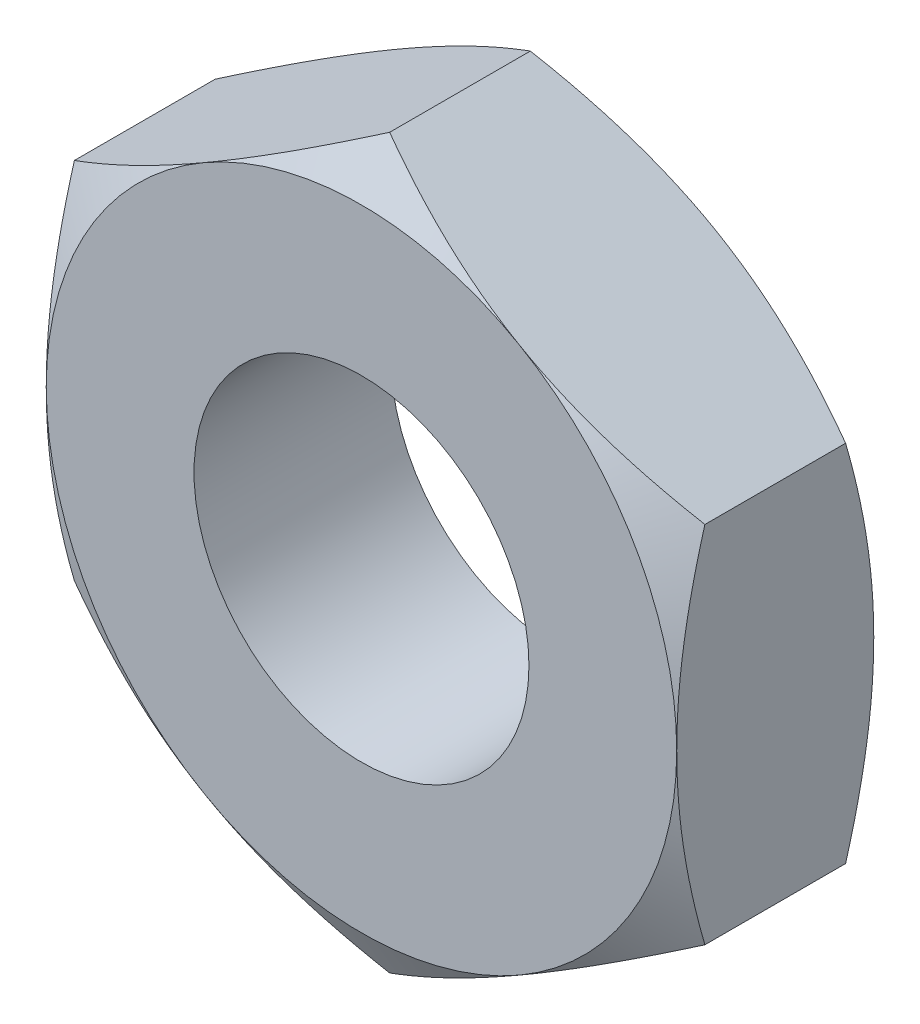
ISO-10303-21;
HEADER;
FILE_DESCRIPTION(('STEP AP214'),'2;1');
FILE_NAME('part.step','',(''),(''),'','','');
FILE_SCHEMA(('AUTOMOTIVE_DESIGN { 1 0 10303 214 1 1 1 1 }'));
ENDSEC;
DATA;
#1=APPLICATION_CONTEXT('core data for automotive mechanical design processes');
#2=APPLICATION_PROTOCOL_DEFINITION('international standard','automotive_design',2000,#1);
#3=PRODUCT_CONTEXT('',#1,'mechanical');
#4=PRODUCT('Part','Part','',(#3));
#5=PRODUCT_RELATED_PRODUCT_CATEGORY('part','',(#4));
#6=PRODUCT_DEFINITION_FORMATION('','',#4);
#7=PRODUCT_DEFINITION_CONTEXT('part definition',#1,'design');
#8=PRODUCT_DEFINITION('design','',#6,#7);
#9=PRODUCT_DEFINITION_SHAPE('','',#8);
#10=(LENGTH_UNIT() NAMED_UNIT(*) SI_UNIT(.MILLI.,.METRE.));
#11=(NAMED_UNIT(*) PLANE_ANGLE_UNIT() SI_UNIT($,.RADIAN.));
#12=(NAMED_UNIT(*) SI_UNIT($,.STERADIAN.) SOLID_ANGLE_UNIT());
#13=UNCERTAINTY_MEASURE_WITH_UNIT(LENGTH_MEASURE(1.E-05),#10,'distance_accuracy_value','');
#14=(GEOMETRIC_REPRESENTATION_CONTEXT(3) GLOBAL_UNCERTAINTY_ASSIGNED_CONTEXT((#13)) GLOBAL_UNIT_ASSIGNED_CONTEXT((#10,
#11,#12)) REPRESENTATION_CONTEXT('',''));
#15=CARTESIAN_POINT('',(0.,0.,0.));
#16=DIRECTION('',(0.,0.,1.));
#17=DIRECTION('',(1.,0.,0.));
#18=AXIS2_PLACEMENT_3D('',#15,#16,#17);
#19=CARTESIAN_POINT('',(0.,9.23760430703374,-5.));
#20=DIRECTION('',(-0.500000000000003,0.866025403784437,0.));
#21=DIRECTION('',(-0.866025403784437,-0.500000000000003,0.));
#22=AXIS2_PLACEMENT_3D('',#19,#20,#21);
#23=PLANE('',#22);
#24=CARTESIAN_POINT('',(0.000199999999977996,9.23771977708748,-0.714597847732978));
#25=CARTESIAN_POINT('',(-0.175648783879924,9.13619343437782,-0.655990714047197));
#26=CARTESIAN_POINT('',(-0.352153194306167,9.03428856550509,-0.600043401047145));
#27=CARTESIAN_POINT('',(-0.706595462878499,8.82965122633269,-0.494201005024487));
#28=CARTESIAN_POINT('',(-0.884533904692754,8.72691841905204,-0.444308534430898));
#29=CARTESIAN_POINT('',(-1.42119823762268,8.41707512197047,-0.30469279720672));
#30=CARTESIAN_POINT('',(-1.78204258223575,8.20874154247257,-0.225281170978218));
#31=CARTESIAN_POINT('',(-2.32203917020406,7.89697436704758,-0.132161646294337));
#32=CARTESIAN_POINT('',(-2.49957818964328,7.79447216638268,-0.105634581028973));
#33=CARTESIAN_POINT('',(-2.85545911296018,7.58900421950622,-0.061153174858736));
#34=CARTESIAN_POINT('',(-3.03380094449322,7.48603851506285,-0.0431980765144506));
#35=CARTESIAN_POINT('',(-3.39079168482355,7.27992981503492,-0.016315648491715));
#36=CARTESIAN_POINT('',(-3.56944001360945,7.17678715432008,-0.00737807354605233));
#37=CARTESIAN_POINT('',(-3.92690170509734,6.97040655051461,0.00127769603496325));
#38=CARTESIAN_POINT('',(-4.10571506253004,6.8671686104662,0.000996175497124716));
#39=CARTESIAN_POINT('',(-4.4400133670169,6.67416139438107,-0.00814502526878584));
#40=CARTESIAN_POINT('',(-4.59552190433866,6.58437849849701,-0.0158896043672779));
#41=CARTESIAN_POINT('',(-4.90617476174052,6.40502298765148,-0.0382011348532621));
#42=CARTESIAN_POINT('',(-5.06131905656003,6.31545038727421,-0.0527685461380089));
#43=CARTESIAN_POINT('',(-5.5261513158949,6.04707935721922,-0.106360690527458));
#44=CARTESIAN_POINT('',(-5.83501648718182,5.8687559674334,-0.155268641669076));
#45=CARTESIAN_POINT('',(-6.45602322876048,5.51021755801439,-0.277539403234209));
#46=CARTESIAN_POINT('',(-6.76808554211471,5.3300482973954,-0.351420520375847));
#47=CARTESIAN_POINT('',(-7.38755648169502,4.97239658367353,-0.519100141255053));
#48=CARTESIAN_POINT('',(-7.694973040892,4.79490955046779,-0.612859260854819));
#49=CARTESIAN_POINT('',(-8.00020000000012,4.61868668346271,-0.714597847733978));
#50=B_SPLINE_CURVE_WITH_KNOTS('',3,(#24,#25,#26,#27,#28,#29,#30,#31,#32,#33,#34,#35,#36,#37,#38,
#39,#40,#41,#42,#43,#44,#45,#46,#47,#48,#49),.UNSPECIFIED.,.F.,.F.,(4,2,2,2,2,2,2,2,2,2,2,2,4),
(0.,0.633973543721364,1.26821965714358,2.53934712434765,3.15934343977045,3.77928496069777,
4.39852133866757,5.01773858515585,5.55680239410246,6.09590254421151,7.17487077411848,
8.27776850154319,9.37850115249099),.UNSPECIFIED.);
#51=CARTESIAN_POINT('',(0.,9.23760430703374,-0.714531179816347));
#52=VERTEX_POINT('',#51);
#53=CARTESIAN_POINT('',(-4.00000000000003,6.92820323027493,0.));
#54=VERTEX_POINT('',#53);
#55=EDGE_CURVE('E143',#52,#54,#50,.T.);
#56=ORIENTED_EDGE('',*,*,#55,.F.);
#57=DIRECTION('',(0.,0.,0.999999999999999));
#58=VECTOR('',#57,1.);
#59=CARTESIAN_POINT('',(0.,9.23760430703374,-5.));
#60=LINE('',#59,#58);
#61=CARTESIAN_POINT('',(0.,9.23760430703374,-4.28546882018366));
#62=VERTEX_POINT('',#61);
#63=EDGE_CURVE('E173',#62,#52,#60,.T.);
#64=ORIENTED_EDGE('',*,*,#63,.F.);
#65=CARTESIAN_POINT('',(-8.00020000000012,4.61868668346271,-4.28540215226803));
#66=CARTESIAN_POINT('',(-7.82435121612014,4.72021302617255,-4.34400928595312));
#67=CARTESIAN_POINT('',(-7.64784680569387,4.82211789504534,-4.39995659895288));
#68=CARTESIAN_POINT('',(-7.29340453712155,5.02675523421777,-4.50579899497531));
#69=CARTESIAN_POINT('',(-7.11546609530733,5.12948804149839,-4.55569146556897));
#70=CARTESIAN_POINT('',(-6.57880176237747,5.4393313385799,-4.69530720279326));
#71=CARTESIAN_POINT('',(-6.21795741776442,5.64766491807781,-4.77471882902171));
#72=CARTESIAN_POINT('',(-5.67796082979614,5.95943209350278,-4.86783835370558));
#73=CARTESIAN_POINT('',(-5.50042181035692,6.06193429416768,-4.89436541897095));
#74=CARTESIAN_POINT('',(-5.14454088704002,6.26740224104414,-4.93884682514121));
#75=CARTESIAN_POINT('',(-4.96619905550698,6.37036794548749,-4.9568019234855));
#76=CARTESIAN_POINT('',(-4.60920831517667,6.57647664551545,-4.98368435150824));
#77=CARTESIAN_POINT('',(-4.4305599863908,6.67961930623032,-4.99262192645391));
#78=CARTESIAN_POINT('',(-4.07309829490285,6.88599991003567,-5.00127769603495));
#79=CARTESIAN_POINT('',(-3.89428493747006,6.98923785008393,-5.00099617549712));
#80=CARTESIAN_POINT('',(-3.55998663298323,7.18224506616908,-4.99185497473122));
#81=CARTESIAN_POINT('',(-3.40447809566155,7.27202796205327,-4.98411039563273));
#82=CARTESIAN_POINT('',(-3.09382523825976,7.4513834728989,-4.96179886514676));
#83=CARTESIAN_POINT('',(-2.93868094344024,7.54095607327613,-4.94723145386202));
#84=CARTESIAN_POINT('',(-2.47384868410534,7.80932710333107,-4.8936393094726));
#85=CARTESIAN_POINT('',(-2.16498351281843,7.98765049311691,-4.84473135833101));
#86=CARTESIAN_POINT('',(-1.54397677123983,8.34618890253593,-4.72246059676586));
#87=CARTESIAN_POINT('',(-1.23191445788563,8.52635816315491,-4.64857947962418));
#88=CARTESIAN_POINT('',(-0.612443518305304,8.88400987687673,-4.48089985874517));
#89=CARTESIAN_POINT('',(-0.305026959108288,9.06149691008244,-4.38714073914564));
#90=CARTESIAN_POINT('',(0.000199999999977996,9.23771977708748,-4.28540215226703));
#91=B_SPLINE_CURVE_WITH_KNOTS('',3,(#65,#66,#67,#68,#69,#70,#71,#72,#73,#74,#75,#76,#77,#78,#79,
#80,#81,#82,#83,#84,#85,#86,#87,#88,#89,#90),.UNSPECIFIED.,.F.,.F.,(4,2,2,2,2,2,2,2,2,2,2,2,4),
(0.,0.633973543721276,1.26821965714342,2.53934712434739,3.15934343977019,3.77928496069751,
4.3985213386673,5.01773858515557,5.55680239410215,6.09590254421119,7.17487077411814,
8.27776850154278,9.37850115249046),.UNSPECIFIED.);
#92=CARTESIAN_POINT('',(-4.00000000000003,6.92820323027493,-5.));
#93=VERTEX_POINT('',#92);
#94=EDGE_CURVE('E159',#93,#62,#91,.T.);
#95=ORIENTED_EDGE('',*,*,#94,.F.);
#96=CARTESIAN_POINT('',(-8.00000000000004,4.61880215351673,-4.28546882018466));
#97=VERTEX_POINT('',#96);
#98=EDGE_CURVE('E156',#97,#93,#91,.T.);
#99=ORIENTED_EDGE('',*,*,#98,.F.);
#100=DIRECTION('',(0.,0.,0.999999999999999));
#101=VECTOR('',#100,1.);
#102=CARTESIAN_POINT('',(-8.00000000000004,4.61880215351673,-5.000000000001));
#103=LINE('',#102,#101);
#104=CARTESIAN_POINT('',(-8.00000000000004,4.61880215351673,-0.714531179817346));
#105=VERTEX_POINT('',#104);
#106=EDGE_CURVE('E149',#97,#105,#103,.T.);
#107=ORIENTED_EDGE('',*,*,#106,.T.);
#108=EDGE_CURVE('E132',#54,#105,#50,.T.);
#109=ORIENTED_EDGE('',*,*,#108,.F.);
#110=EDGE_LOOP('',(#56,#64,#95,#99,#107,#109));
#111=FACE_BOUND('',#110,.T.);
#112=ADVANCED_FACE('F40',(#111),#23,.T.);
#113=CARTESIAN_POINT('',(8.00000000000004,4.61880215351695,-5.));
#114=DIRECTION('',(0.500000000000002,0.866025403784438,0.));
#115=DIRECTION('',(-0.866025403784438,0.500000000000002,0.));
#116=AXIS2_PLACEMENT_3D('',#113,#114,#115);
#117=PLANE('',#116);
#118=CARTESIAN_POINT('',(8.00019999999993,4.61868668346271,-0.714597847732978));
#119=CARTESIAN_POINT('',(7.82435121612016,4.72021302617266,-0.655990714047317));
#120=CARTESIAN_POINT('',(7.64784680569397,4.8221178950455,-0.600043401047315));
#121=CARTESIAN_POINT('',(7.29340453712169,5.02675523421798,-0.494201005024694));
#122=CARTESIAN_POINT('',(7.11546609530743,5.1294880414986,-0.444308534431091));
#123=CARTESIAN_POINT('',(6.57880176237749,5.43933133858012,-0.304692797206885));
#124=CARTESIAN_POINT('',(6.21795741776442,5.64766491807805,-0.225281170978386));
#125=CARTESIAN_POINT('',(5.67796082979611,5.95943209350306,-0.132161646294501));
#126=CARTESIAN_POINT('',(5.50042181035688,6.06193429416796,-0.105634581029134));
#127=CARTESIAN_POINT('',(5.14454088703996,6.26740224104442,-0.0611531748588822));
#128=CARTESIAN_POINT('',(4.96619905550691,6.37036794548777,-0.0431980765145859));
#129=CARTESIAN_POINT('',(4.60920831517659,6.57647664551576,-0.0163156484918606));
#130=CARTESIAN_POINT('',(4.43055998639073,6.67961930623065,-0.00737807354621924));
#131=CARTESIAN_POINT('',(4.07309829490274,6.88599991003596,0.00127769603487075));
#132=CARTESIAN_POINT('',(3.8942849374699,6.98923785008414,0.000996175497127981));
#133=CARTESIAN_POINT('',(3.55998663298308,7.18224506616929,-0.00814502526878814));
#134=CARTESIAN_POINT('',(3.40447809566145,7.27202796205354,-0.0158896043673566));
#135=CARTESIAN_POINT('',(3.09382523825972,7.45138347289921,-0.0382011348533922));
#136=CARTESIAN_POINT('',(2.93868094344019,7.54095607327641,-0.0527685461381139));
#137=CARTESIAN_POINT('',(2.47384868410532,7.8093271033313,-0.106360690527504));
#138=CARTESIAN_POINT('',(2.16498351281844,7.98765049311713,-0.155268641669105));
#139=CARTESIAN_POINT('',(1.54397677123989,8.34618890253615,-0.277539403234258));
#140=CARTESIAN_POINT('',(1.23191445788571,8.52635816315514,-0.351420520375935));
#141=CARTESIAN_POINT('',(0.61244351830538,8.88400987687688,-0.519100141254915));
#142=CARTESIAN_POINT('',(0.30502695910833,9.06149691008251,-0.612859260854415));
#143=CARTESIAN_POINT('',(-0.000200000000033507,9.23771977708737,-0.714597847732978));
#144=B_SPLINE_CURVE_WITH_KNOTS('',3,(#118,#119,#120,#121,#122,#123,#124,#125,#126,#127,#128,
#129,#130,#131,#132,#133,#134,#135,#136,#137,#138,#139,#140,#141,#142,#143),.UNSPECIFIED.,.F.,
.F.,(4,2,2,2,2,2,2,2,2,2,2,2,4),(0.,0.633973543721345,1.26821965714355,2.53934712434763,
3.15934343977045,3.77928496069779,4.39852133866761,5.01773858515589,5.55680239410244,
6.09590254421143,7.1748707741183,8.27776850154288,9.37850115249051),.UNSPECIFIED.);
#145=CARTESIAN_POINT('',(8.00000000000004,4.61880215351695,-0.714531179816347));
#146=VERTEX_POINT('',#145);
#147=CARTESIAN_POINT('',(4.00000000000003,6.92820323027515,0.));
#148=VERTEX_POINT('',#147);
#149=EDGE_CURVE('E289',#146,#148,#144,.T.);
#150=ORIENTED_EDGE('',*,*,#149,.F.);
#151=DIRECTION('',(0.,0.,0.999999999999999));
#152=VECTOR('',#151,1.);
#153=CARTESIAN_POINT('',(8.00000000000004,4.61880215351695,-5.));
#154=LINE('',#153,#152);
#155=CARTESIAN_POINT('',(8.00000000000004,4.61880215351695,-4.28546882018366));
#156=VERTEX_POINT('',#155);
#157=EDGE_CURVE('E186',#156,#146,#154,.T.);
#158=ORIENTED_EDGE('',*,*,#157,.F.);
#159=CARTESIAN_POINT('',(-0.000200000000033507,9.23771977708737,-4.28540215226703));
#160=CARTESIAN_POINT('',(0.175648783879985,9.13619343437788,-4.34400928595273));
#161=CARTESIAN_POINT('',(0.352153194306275,9.03428856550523,-4.39995659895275));
#162=CARTESIAN_POINT('',(0.706595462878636,8.8296512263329,-4.50579899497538));
#163=CARTESIAN_POINT('',(0.884533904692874,8.72691841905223,-4.55569146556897));
#164=CARTESIAN_POINT('',(1.42119823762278,8.41707512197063,-4.69530720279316));
#165=CARTESIAN_POINT('',(1.78204258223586,8.20874154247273,-4.77471882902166));
#166=CARTESIAN_POINT('',(2.32203917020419,7.89697436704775,-4.86783835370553));
#167=CARTESIAN_POINT('',(2.49957818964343,7.79447216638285,-4.89436541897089));
#168=CARTESIAN_POINT('',(2.85545911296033,7.58900421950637,-4.93884682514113));
#169=CARTESIAN_POINT('',(3.03380094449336,7.48603851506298,-4.95680192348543));
#170=CARTESIAN_POINT('',(3.39079168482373,7.27992981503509,-4.98368435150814));
#171=CARTESIAN_POINT('',(3.56944001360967,7.17678715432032,-4.99262192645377));
#172=CARTESIAN_POINT('',(3.92690170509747,6.97040655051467,-5.00127769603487));
#173=CARTESIAN_POINT('',(4.10571506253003,6.86716861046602,-5.00099617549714));
#174=CARTESIAN_POINT('',(4.44001336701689,6.67416139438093,-4.99185497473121));
#175=CARTESIAN_POINT('',(4.59552190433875,6.5843784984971,-4.98411039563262));
#176=CARTESIAN_POINT('',(4.90617476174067,6.40502298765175,-4.96179886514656));
#177=CARTESIAN_POINT('',(5.06131905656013,6.31545038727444,-4.94723145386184));
#178=CARTESIAN_POINT('',(5.52615131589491,6.04707935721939,-4.89363930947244));
#179=CARTESIAN_POINT('',(5.83501648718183,5.86875596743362,-4.84473135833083));
#180=CARTESIAN_POINT('',(6.45602322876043,5.5102175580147,-4.72246059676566));
#181=CARTESIAN_POINT('',(6.76808554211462,5.33004829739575,-4.64857947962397));
#182=CARTESIAN_POINT('',(7.38755648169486,4.97239658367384,-4.480899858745));
#183=CARTESIAN_POINT('',(7.69497304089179,4.79490955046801,-4.38714073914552));
#184=CARTESIAN_POINT('',(8.00019999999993,4.61868668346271,-4.28540215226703));
#185=B_SPLINE_CURVE_WITH_KNOTS('',3,(#159,#160,#161,#162,#163,#164,#165,#166,#167,#168,#169,
#170,#171,#172,#173,#174,#175,#176,#177,#178,#179,#180,#181,#182,#183,#184),.UNSPECIFIED.,.F.,
.F.,(4,2,2,2,2,2,2,2,2,2,2,2,4),(0.,0.633973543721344,1.26821965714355,2.53934712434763,
3.15934343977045,3.77928496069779,4.39852133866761,5.01773858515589,5.55680239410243,
6.09590254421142,7.1748707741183,8.27776850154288,9.3785011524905),.UNSPECIFIED.);
#186=CARTESIAN_POINT('',(4.00000000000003,6.9282032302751,-5.));
#187=VERTEX_POINT('',#186);
#188=EDGE_CURVE('E268',#187,#156,#185,.T.);
#189=ORIENTED_EDGE('',*,*,#188,.F.);
#190=EDGE_CURVE('E166',#62,#187,#185,.T.);
#191=ORIENTED_EDGE('',*,*,#190,.F.);
#192=ORIENTED_EDGE('',*,*,#63,.T.);
#193=EDGE_CURVE('E283',#148,#52,#144,.T.);
#194=ORIENTED_EDGE('',*,*,#193,.F.);
#195=EDGE_LOOP('',(#150,#158,#189,#191,#192,#194));
#196=FACE_BOUND('',#195,.T.);
#197=ADVANCED_FACE('F275',(#196),#117,.T.);
#198=CARTESIAN_POINT('',(8.00000000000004,4.61880215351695,-5.));
#199=DIRECTION('',(-1.,0.,0.));
#200=DIRECTION('',(0.,0.,0.999999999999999));
#201=AXIS2_PLACEMENT_3D('',#198,#199,#200);
#202=PLANE('',#201);
#203=ORIENTED_EDGE('',*,*,#157,.T.);
#204=CARTESIAN_POINT('',(7.99999999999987,-12.2497439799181,-3.82821364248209));
#205=CARTESIAN_POINT('',(7.99999999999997,-11.8984987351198,-3.65847254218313));
#206=CARTESIAN_POINT('',(8.00000000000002,-11.5464230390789,-3.49041880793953));
#207=CARTESIAN_POINT('',(8.00000000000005,-10.8401616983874,-3.1586502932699));
#208=CARTESIAN_POINT('',(8.00000000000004,-10.4859757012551,-2.99493626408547));
#209=CARTESIAN_POINT('',(8.00000000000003,-9.77313142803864,-2.67194892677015));
#210=CARTESIAN_POINT('',(8.00000000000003,-9.41445915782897,-2.51270639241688));
#211=CARTESIAN_POINT('',(8.00000000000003,-8.69416671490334,-2.20106116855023));
#212=CARTESIAN_POINT('',(8.00000000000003,-8.33254669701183,-2.04865812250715));
#213=CARTESIAN_POINT('',(8.00000000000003,-7.60129405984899,-1.75070130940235));
#214=CARTESIAN_POINT('',(8.00000000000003,-7.23161757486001,-1.60525460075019));
#215=CARTESIAN_POINT('',(8.00000000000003,-6.48790521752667,-1.32575242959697));
#216=CARTESIAN_POINT('',(8.00000000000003,-6.11386886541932,-1.19169823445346));
#217=CARTESIAN_POINT('',(8.00000000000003,-5.36160531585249,-0.938583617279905));
#218=CARTESIAN_POINT('',(8.00000000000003,-4.98338896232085,-0.81949131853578));
#219=CARTESIAN_POINT('',(8.00000000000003,-4.2215930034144,-0.600166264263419));
#220=CARTESIAN_POINT('',(8.00000000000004,-3.83801513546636,-0.499927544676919));
#221=CARTESIAN_POINT('',(8.00000000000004,-3.0651700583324,-0.323183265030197));
#222=CARTESIAN_POINT('',(8.00000000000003,-2.6759013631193,-0.246684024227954));
#223=CARTESIAN_POINT('',(8.00000000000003,-2.0885729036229,-0.153570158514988));
#224=CARTESIAN_POINT('',(8.00000000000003,-1.89220175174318,-0.126136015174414));
#225=CARTESIAN_POINT('',(8.00000000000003,-1.49853877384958,-0.0790191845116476));
#226=CARTESIAN_POINT('',(8.00000000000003,-1.30124704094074,-0.0593357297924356));
#227=CARTESIAN_POINT('',(8.00000000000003,-0.907261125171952,-0.0282499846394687));
#228=CARTESIAN_POINT('',(8.00000000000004,-0.710571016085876,-0.0167962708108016));
#229=CARTESIAN_POINT('',(8.00000000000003,-0.316882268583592,-0.00223056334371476));
#230=CARTESIAN_POINT('',(8.00000000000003,-0.119883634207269,0.000881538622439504));
#231=CARTESIAN_POINT('',(8.00000000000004,0.274012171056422,-0.00131013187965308));
#232=CARTESIAN_POINT('',(8.00000000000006,0.470909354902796,-0.0066115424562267));
#233=CARTESIAN_POINT('',(8.00000000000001,0.86430865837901,-0.0254984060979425));
#234=CARTESIAN_POINT('',(7.99999999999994,1.06081075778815,-0.0390842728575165));
#235=CARTESIAN_POINT('',(7.9999999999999,1.53707134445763,-0.0817685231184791));
#236=CARTESIAN_POINT('',(8.,1.8164639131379,-0.115017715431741));
#237=CARTESIAN_POINT('',(8.00000000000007,2.37310809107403,-0.196418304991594));
#238=CARTESIAN_POINT('',(8.00000000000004,2.65035909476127,-0.244573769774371));
#239=CARTESIAN_POINT('',(8.00000000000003,3.20249141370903,-0.354078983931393));
#240=CARTESIAN_POINT('',(8.00000000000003,3.47737023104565,-0.41544120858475));
#241=CARTESIAN_POINT('',(8.00000000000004,4.0242997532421,-0.54948770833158));
#242=CARTESIAN_POINT('',(8.00000000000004,4.2963507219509,-0.622170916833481));
#243=CARTESIAN_POINT('',(8.00000000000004,4.84432510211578,-0.779020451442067));
#244=CARTESIAN_POINT('',(8.00000000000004,5.12017997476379,-0.863424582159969));
#245=CARTESIAN_POINT('',(8.00000000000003,5.66897392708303,-1.04057245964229));
#246=CARTESIAN_POINT('',(8.00000000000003,5.94191487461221,-1.13331045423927));
#247=CARTESIAN_POINT('',(8.00000000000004,6.48378576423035,-1.32521046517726));
#248=CARTESIAN_POINT('',(8.00000000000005,6.75272963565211,-1.42433338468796));
#249=CARTESIAN_POINT('',(8.00000000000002,7.2885307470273,-1.62839717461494));
#250=CARTESIAN_POINT('',(7.99999999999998,7.55538709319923,-1.73334039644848));
#251=CARTESIAN_POINT('',(7.99999999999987,7.82127397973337,-1.84061801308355));
#252=B_SPLINE_CURVE_WITH_KNOTS('',3,(#204,#205,#206,#207,#208,#209,#210,#211,#212,#213,#214,
#215,#216,#217,#218,#219,#220,#221,#222,#223,#224,#225,#226,#227,#228,#229,#230,#231,#232,#233,
#234,#235,#236,#237,#238,#239,#240,#241,#242,#243,#244,#245,#246,#247,#248,#249,#250,#251),
.UNSPECIFIED.,.F.,.F.,(4,2,2,2,2,2,2,2,2,2,2,2,2,2,2,2,2,2,2,2,2,2,2,4),(0.,1.17034358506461,
2.34088846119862,3.51813189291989,4.69531388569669,5.88694801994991,7.07871454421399,
8.26789729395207,9.45670322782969,10.6458253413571,11.2405311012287,11.8351779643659,
12.4260760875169,13.0169665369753,13.6076911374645,14.1984452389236,15.0420672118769,
15.8859195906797,16.7305726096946,17.5751460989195,18.4404219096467,19.3051050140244,
20.1649211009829,21.0250871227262),.UNSPECIFIED.);
#253=CARTESIAN_POINT('',(7.99999999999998,-4.9960036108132E-13,0.));
#254=VERTEX_POINT('',#253);
#255=EDGE_CURVE('E213',#146,#254,#252,.F.);
#256=ORIENTED_EDGE('',*,*,#255,.T.);
#257=CARTESIAN_POINT('',(7.9999999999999,-4.61880215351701,-0.714531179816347));
#258=VERTEX_POINT('',#257);
#259=EDGE_CURVE('E293',#254,#258,#252,.F.);
#260=ORIENTED_EDGE('',*,*,#259,.T.);
#261=DIRECTION('',(0.,0.,0.999999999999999));
#262=VECTOR('',#261,1.);
#263=CARTESIAN_POINT('',(7.9999999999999,-4.61880215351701,-5.));
#264=LINE('',#263,#262);
#265=CARTESIAN_POINT('',(7.9999999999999,-4.61880215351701,-4.28546882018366));
#266=VERTEX_POINT('',#265);
#267=EDGE_CURVE('E345',#266,#258,#264,.T.);
#268=ORIENTED_EDGE('',*,*,#267,.F.);
#269=CARTESIAN_POINT('',(7.99999999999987,-12.2497439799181,-1.1717863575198));
#270=CARTESIAN_POINT('',(7.99999999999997,-11.8984987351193,-1.34152745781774));
#271=CARTESIAN_POINT('',(8.00000000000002,-11.5464230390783,-1.50958119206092));
#272=CARTESIAN_POINT('',(8.00000000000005,-10.8401616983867,-1.84134970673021));
#273=CARTESIAN_POINT('',(8.00000000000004,-10.4859757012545,-2.00506373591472));
#274=CARTESIAN_POINT('',(8.00000000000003,-9.77313142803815,-2.32805107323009));
#275=CARTESIAN_POINT('',(8.00000000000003,-9.41445915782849,-2.48729360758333));
#276=CARTESIAN_POINT('',(8.00000000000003,-8.6941667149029,-2.79893883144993));
#277=CARTESIAN_POINT('',(8.00000000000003,-8.33254669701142,-2.951341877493));
#278=CARTESIAN_POINT('',(8.00000000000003,-7.60129405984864,-3.24929869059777));
#279=CARTESIAN_POINT('',(8.00000000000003,-7.23161757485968,-3.39474539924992));
#280=CARTESIAN_POINT('',(8.00000000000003,-6.4879052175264,-3.67424757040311));
#281=CARTESIAN_POINT('',(8.00000000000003,-6.11386886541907,-3.80830176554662));
#282=CARTESIAN_POINT('',(8.00000000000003,-5.36160531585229,-4.06141638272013));
#283=CARTESIAN_POINT('',(8.00000000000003,-4.98338896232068,-4.18050868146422));
#284=CARTESIAN_POINT('',(8.00000000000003,-4.2215930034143,-4.39983373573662));
#285=CARTESIAN_POINT('',(8.00000000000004,-3.83801513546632,-4.50007245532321));
#286=CARTESIAN_POINT('',(8.00000000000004,-3.06517005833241,-4.67681673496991));
#287=CARTESIAN_POINT('',(8.00000000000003,-2.67590136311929,-4.75331597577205));
#288=CARTESIAN_POINT('',(8.00000000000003,-2.08857290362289,-4.84642984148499));
#289=CARTESIAN_POINT('',(8.00000000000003,-1.89220175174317,-4.87386398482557));
#290=CARTESIAN_POINT('',(8.00000000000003,-1.49853877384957,-4.92098081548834));
#291=CARTESIAN_POINT('',(8.00000000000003,-1.30124704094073,-4.94066427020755));
#292=CARTESIAN_POINT('',(8.00000000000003,-0.907261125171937,-4.97175001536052));
#293=CARTESIAN_POINT('',(8.00000000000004,-0.710571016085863,-4.98320372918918));
#294=CARTESIAN_POINT('',(8.00000000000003,-0.31688226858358,-4.99776943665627));
#295=CARTESIAN_POINT('',(8.00000000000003,-0.119883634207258,-5.00088153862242));
#296=CARTESIAN_POINT('',(8.00000000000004,0.274012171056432,-4.99868986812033));
#297=CARTESIAN_POINT('',(8.00000000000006,0.470909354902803,-4.99338845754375));
#298=CARTESIAN_POINT('',(8.00000000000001,0.864308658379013,-4.97450159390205));
#299=CARTESIAN_POINT('',(7.99999999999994,1.06081075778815,-4.96091572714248));
#300=CARTESIAN_POINT('',(7.9999999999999,1.53707134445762,-4.91823147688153));
#301=CARTESIAN_POINT('',(8.,1.81646391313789,-4.88498228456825));
#302=CARTESIAN_POINT('',(8.00000000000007,2.37310809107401,-4.80358169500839));
#303=CARTESIAN_POINT('',(8.00000000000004,2.65035909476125,-4.75542623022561));
#304=CARTESIAN_POINT('',(8.00000000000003,3.20249141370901,-4.6459210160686));
#305=CARTESIAN_POINT('',(8.00000000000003,3.47737023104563,-4.58455879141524));
#306=CARTESIAN_POINT('',(8.00000000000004,4.02429975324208,-4.45051229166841));
#307=CARTESIAN_POINT('',(8.00000000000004,4.29635072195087,-4.37782908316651));
#308=CARTESIAN_POINT('',(8.00000000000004,4.84432510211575,-4.22097954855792));
#309=CARTESIAN_POINT('',(8.00000000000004,5.12017997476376,-4.13657541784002));
#310=CARTESIAN_POINT('',(8.00000000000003,5.66897392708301,-3.9594275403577));
#311=CARTESIAN_POINT('',(8.00000000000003,5.9419148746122,-3.86668954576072));
#312=CARTESIAN_POINT('',(8.00000000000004,6.48378576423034,-3.67478953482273));
#313=CARTESIAN_POINT('',(8.00000000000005,6.7527296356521,-3.57566661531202));
#314=CARTESIAN_POINT('',(8.00000000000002,7.28853074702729,-3.37160282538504));
#315=CARTESIAN_POINT('',(7.99999999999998,7.55538709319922,-3.2666596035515));
#316=CARTESIAN_POINT('',(7.99999999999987,7.82127397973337,-3.15938198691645));
#317=B_SPLINE_CURVE_WITH_KNOTS('',3,(#269,#270,#271,#272,#273,#274,#275,#276,#277,#278,#279,
#280,#281,#282,#283,#284,#285,#286,#287,#288,#289,#290,#291,#292,#293,#294,#295,#296,#297,#298,
#299,#300,#301,#302,#303,#304,#305,#306,#307,#308,#309,#310,#311,#312,#313,#314,#315,#316),
.UNSPECIFIED.,.F.,.F.,(4,2,2,2,2,2,2,2,2,2,2,2,2,2,2,2,2,2,2,2,2,2,2,4),(0.,1.17034358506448,
2.34088846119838,3.51813189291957,4.69531388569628,5.88694801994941,7.07871454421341,
8.26789729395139,9.45670322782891,10.6458253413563,11.2405311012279,11.8351779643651,
12.4260760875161,13.0169665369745,13.6076911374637,14.1984452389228,15.0420672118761,
15.8859195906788,16.7305726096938,17.5751460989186,18.4404219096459,19.3051050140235,
20.1649211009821,21.0250871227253),.UNSPECIFIED.);
#318=CARTESIAN_POINT('',(7.99999999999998,-4.9960036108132E-13,-5.));
#319=VERTEX_POINT('',#318);
#320=EDGE_CURVE('E258',#266,#319,#317,.T.);
#321=ORIENTED_EDGE('',*,*,#320,.T.);
#322=EDGE_CURVE('E267',#319,#156,#317,.T.);
#323=ORIENTED_EDGE('',*,*,#322,.T.);
#324=EDGE_LOOP('',(#203,#256,#260,#268,#321,#323));
#325=FACE_BOUND('',#324,.T.);
#326=ADVANCED_FACE('F278',(#325),#202,.F.);
#327=CARTESIAN_POINT('',(0.,-9.23760430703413,-5.000000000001));
#328=DIRECTION('',(0.500000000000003,-0.866025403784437,0.));
#329=DIRECTION('',(0.866025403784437,0.500000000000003,0.));
#330=AXIS2_PLACEMENT_3D('',#327,#328,#329);
#331=PLANE('',#330);
#332=CARTESIAN_POINT('',(-0.000200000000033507,-9.2377197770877,-0.714597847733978));
#333=CARTESIAN_POINT('',(0.175648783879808,-9.13619343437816,-0.655990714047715));
#334=CARTESIAN_POINT('',(0.352153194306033,-9.03428856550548,-0.600043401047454));
#335=CARTESIAN_POINT('',(0.706595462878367,-8.82965122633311,-0.494201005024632));
#336=CARTESIAN_POINT('',(0.88453390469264,-8.72691841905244,-0.444308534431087));
#337=CARTESIAN_POINT('',(1.42119823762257,-8.41707512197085,-0.304692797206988));
#338=CARTESIAN_POINT('',(1.78204258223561,-8.20874154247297,-0.225281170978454));
#339=CARTESIAN_POINT('',(2.3220391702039,-7.896974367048,-0.132161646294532));
#340=CARTESIAN_POINT('',(2.49957818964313,-7.79447216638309,-0.105634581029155));
#341=CARTESIAN_POINT('',(2.85545911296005,-7.58900421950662,-0.0611531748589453));
#342=CARTESIAN_POINT('',(3.03380094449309,-7.48603851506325,-0.0431980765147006));
#343=CARTESIAN_POINT('',(3.39079168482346,-7.2799298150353,-0.0163156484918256));
#344=CARTESIAN_POINT('',(3.56944001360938,-7.17678715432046,-0.00737807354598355));
#345=CARTESIAN_POINT('',(3.9269017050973,-6.97040655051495,0.001277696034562));
#346=CARTESIAN_POINT('',(4.10571506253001,-6.8671686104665,0.000996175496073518));
#347=CARTESIAN_POINT('',(4.4400133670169,-6.67416139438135,-0.00814502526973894));
#348=CARTESIAN_POINT('',(4.59552190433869,-6.58437849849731,-0.0158896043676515));
#349=CARTESIAN_POINT('',(4.90617476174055,-6.4050229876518,-0.0382011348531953));
#350=CARTESIAN_POINT('',(5.06131905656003,-6.31545038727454,-0.0527685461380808));
#351=CARTESIAN_POINT('',(5.52615131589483,-6.04707935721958,-0.106360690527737));
#352=CARTESIAN_POINT('',(5.83501648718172,-5.86875596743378,-0.155268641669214));
#353=CARTESIAN_POINT('',(6.45602322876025,-5.51021755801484,-0.277539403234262));
#354=CARTESIAN_POINT('',(6.76808554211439,-5.33004829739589,-0.351420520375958));
#355=CARTESIAN_POINT('',(7.38755648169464,-4.97239658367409,-0.519100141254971));
#356=CARTESIAN_POINT('',(7.69497304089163,-4.79490955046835,-0.612859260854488));
#357=CARTESIAN_POINT('',(8.00019999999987,-4.61868668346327,-0.714597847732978));
#358=B_SPLINE_CURVE_WITH_KNOTS('',3,(#332,#333,#334,#335,#336,#337,#338,#339,#340,#341,#342,
#343,#344,#345,#346,#347,#348,#349,#350,#351,#352,#353,#354,#355,#356,#357),.UNSPECIFIED.,.F.,
.F.,(4,2,2,2,2,2,2,2,2,2,2,2,4),(0.,0.633973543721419,1.26821965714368,2.53934712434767,
3.15934343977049,3.77928496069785,4.39852133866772,5.01773858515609,5.55680239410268,
6.09590254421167,7.17487077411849,8.27776850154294,9.37850115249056),.UNSPECIFIED.);
#359=CARTESIAN_POINT('',(0.,-9.23760430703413,-0.714531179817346));
#360=VERTEX_POINT('',#359);
#361=CARTESIAN_POINT('',(3.99999999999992,-6.92820323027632,-9.99200722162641E-13));
#362=VERTEX_POINT('',#361);
#363=EDGE_CURVE('E57',#360,#362,#358,.T.);
#364=ORIENTED_EDGE('',*,*,#363,.F.);
#365=DIRECTION('',(0.,0.,0.999999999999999));
#366=VECTOR('',#365,1.);
#367=CARTESIAN_POINT('',(0.,-9.23760430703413,-5.000000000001));
#368=LINE('',#367,#366);
#369=CARTESIAN_POINT('',(0.,-9.23760430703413,-4.28546882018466));
#370=VERTEX_POINT('',#369);
#371=EDGE_CURVE('E163',#370,#360,#368,.T.);
#372=ORIENTED_EDGE('',*,*,#371,.F.);
#373=CARTESIAN_POINT('',(8.00019999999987,-4.61868668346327,-4.28540215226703));
#374=CARTESIAN_POINT('',(7.82435121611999,-4.72021302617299,-4.34400928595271));
#375=CARTESIAN_POINT('',(7.64784680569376,-4.82211789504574,-4.39995659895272));
#376=CARTESIAN_POINT('',(7.29340453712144,-5.02675523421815,-4.50579899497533));
#377=CARTESIAN_POINT('',(7.11546609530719,-5.12948804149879,-4.55569146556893));
#378=CARTESIAN_POINT('',(6.57880176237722,-5.43933133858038,-4.69530720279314));
#379=CARTESIAN_POINT('',(6.21795741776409,-5.64766491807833,-4.77471882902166));
#380=CARTESIAN_POINT('',(5.6779608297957,-5.95943209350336,-4.86783835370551));
#381=CARTESIAN_POINT('',(5.50042181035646,-6.06193429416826,-4.89436541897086));
#382=CARTESIAN_POINT('',(5.14454088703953,-6.26740224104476,-4.93884682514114));
#383=CARTESIAN_POINT('',(4.9661990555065,-6.37036794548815,-4.95680192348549));
#384=CARTESIAN_POINT('',(4.60920831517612,-6.57647664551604,-4.98368435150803));
#385=CARTESIAN_POINT('',(4.43055998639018,-6.6796193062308,-4.99262192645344));
#386=CARTESIAN_POINT('',(4.07309829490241,-6.88599991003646,-5.00127769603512));
#387=CARTESIAN_POINT('',(3.89428493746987,-6.98923785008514,-5.0009961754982));
#388=CARTESIAN_POINT('',(3.55998663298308,-7.18224506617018,-4.99185497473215));
#389=CARTESIAN_POINT('',(3.40447809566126,-7.27202796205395,-4.98411039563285));
#390=CARTESIAN_POINT('',(3.09382523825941,-7.45138347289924,-4.96179886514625));
#391=CARTESIAN_POINT('',(2.93868094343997,-7.54095607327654,-4.94723145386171));
#392=CARTESIAN_POINT('',(2.47384868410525,-7.80932710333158,-4.89363930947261));
#393=CARTESIAN_POINT('',(2.16498351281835,-7.98765049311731,-4.8447313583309));
#394=CARTESIAN_POINT('',(1.54397677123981,-8.34618890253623,-4.72246059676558));
#395=CARTESIAN_POINT('',(1.23191445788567,-8.52635816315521,-4.64857947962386));
#396=CARTESIAN_POINT('',(0.612443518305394,-8.88400987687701,-4.48089985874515));
#397=CARTESIAN_POINT('',(0.305026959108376,-9.0614969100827,-4.38714073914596));
#398=CARTESIAN_POINT('',(-0.000200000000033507,-9.2377197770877,-4.28540215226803));
#399=B_SPLINE_CURVE_WITH_KNOTS('',3,(#373,#374,#375,#376,#377,#378,#379,#380,#381,#382,#383,
#384,#385,#386,#387,#388,#389,#390,#391,#392,#393,#394,#395,#396,#397,#398),.UNSPECIFIED.,.F.,
.F.,(4,2,2,2,2,2,2,2,2,2,2,2,4),(0.,0.63397354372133,1.26821965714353,2.53934712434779,
3.15934343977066,3.77928496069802,4.39852133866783,5.01773858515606,5.55680239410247,
6.09590254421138,7.17487077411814,8.27776850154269,9.37850115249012),.UNSPECIFIED.);
#400=CARTESIAN_POINT('',(3.99999999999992,-6.92820323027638,-5.000000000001));
#401=VERTEX_POINT('',#400);
#402=EDGE_CURVE('E252',#401,#370,#399,.T.);
#403=ORIENTED_EDGE('',*,*,#402,.F.);
#404=EDGE_CURVE('E326',#266,#401,#399,.T.);
#405=ORIENTED_EDGE('',*,*,#404,.F.);
#406=ORIENTED_EDGE('',*,*,#267,.T.);
#407=EDGE_CURVE('E299',#362,#258,#358,.T.);
#408=ORIENTED_EDGE('',*,*,#407,.F.);
#409=EDGE_LOOP('',(#364,#372,#403,#405,#406,#408));
#410=FACE_BOUND('',#409,.T.);
#411=ADVANCED_FACE('F382',(#410),#331,.T.);
#412=CARTESIAN_POINT('',(-8.00000000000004,-4.61880215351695,-5.000000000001));
#413=DIRECTION('',(-0.500000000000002,-0.866025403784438,0.));
#414=DIRECTION('',(0.866025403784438,-0.500000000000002,0.));
#415=AXIS2_PLACEMENT_3D('',#412,#413,#414);
#416=PLANE('',#415);
#417=CARTESIAN_POINT('',(-8.00019999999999,-4.61868668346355,-0.714597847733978));
#418=CARTESIAN_POINT('',(-7.82435121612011,-4.72021302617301,-0.655990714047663));
#419=CARTESIAN_POINT('',(-7.64784680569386,-4.82211789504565,-0.600043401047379));
#420=CARTESIAN_POINT('',(-7.29340453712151,-5.026755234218,-0.494201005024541));
#421=CARTESIAN_POINT('',(-7.11546609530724,-5.12948804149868,-0.444308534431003));
#422=CARTESIAN_POINT('',(-6.57880176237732,-5.43933133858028,-0.304692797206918));
#423=CARTESIAN_POINT('',(-6.21795741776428,-5.64766491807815,-0.225281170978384));
#424=CARTESIAN_POINT('',(-5.67796082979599,-5.95943209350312,-0.132161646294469));
#425=CARTESIAN_POINT('',(-5.50042181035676,-6.06193429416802,-0.105634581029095));
#426=CARTESIAN_POINT('',(-5.14454088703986,-6.26740224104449,-0.061153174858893));
#427=CARTESIAN_POINT('',(-4.96619905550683,-6.37036794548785,-0.0431980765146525));
#428=CARTESIAN_POINT('',(-4.60920831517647,-6.57647664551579,-0.0163156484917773));
#429=CARTESIAN_POINT('',(-4.43055998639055,-6.67961930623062,-0.00737807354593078));
#430=CARTESIAN_POINT('',(-4.07309829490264,-6.88599991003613,0.00127769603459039));
#431=CARTESIAN_POINT('',(-3.89428493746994,-6.98923785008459,0.000996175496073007));
#432=CARTESIAN_POINT('',(-3.55998663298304,-7.18224506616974,-0.00814502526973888));
#433=CARTESIAN_POINT('',(-3.40447809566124,-7.27202796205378,-0.0158896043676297));
#434=CARTESIAN_POINT('',(-3.09382523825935,-7.4513834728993,-0.0382011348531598));
#435=CARTESIAN_POINT('',(-2.93868094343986,-7.54095607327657,-0.0527685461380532));
#436=CARTESIAN_POINT('',(-2.47384868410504,-7.80932710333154,-0.106360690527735));
#437=CARTESIAN_POINT('',(-2.16498351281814,-7.98765049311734,-0.155268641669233));
#438=CARTESIAN_POINT('',(-1.54397677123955,-8.34618890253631,-0.277539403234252));
#439=CARTESIAN_POINT('',(-1.23191445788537,-8.52635816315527,-0.351420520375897));
#440=CARTESIAN_POINT('',(-0.612443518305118,-8.8840098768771,-0.519100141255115));
#441=CARTESIAN_POINT('',(-0.305026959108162,-9.06149691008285,-0.612859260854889));
#442=CARTESIAN_POINT('',(0.00019999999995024,-9.23771977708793,-0.714597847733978));
#443=B_SPLINE_CURVE_WITH_KNOTS('',3,(#417,#418,#419,#420,#421,#422,#423,#424,#425,#426,#427,
#428,#429,#430,#431,#432,#433,#434,#435,#436,#437,#438,#439,#440,#441,#442),.UNSPECIFIED.,.F.,
.F.,(4,2,2,2,2,2,2,2,2,2,2,2,4),(0.,0.63397354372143,1.2682196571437,2.53934712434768,
3.15934343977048,3.77928496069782,4.39852133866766,5.01773858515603,5.55680239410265,
6.09590254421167,7.17487077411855,8.27776850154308,9.37850115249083),.UNSPECIFIED.);
#444=CARTESIAN_POINT('',(-7.99999999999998,-4.61880215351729,-0.714531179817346));
#445=VERTEX_POINT('',#444);
#446=CARTESIAN_POINT('',(-4.00000000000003,-6.92820323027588,-9.99200722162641E-13));
#447=VERTEX_POINT('',#446);
#448=EDGE_CURVE('E64',#445,#447,#443,.T.);
#449=ORIENTED_EDGE('',*,*,#448,.F.);
#450=DIRECTION('',(0.,0.,0.999999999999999));
#451=VECTOR('',#450,1.);
#452=CARTESIAN_POINT('',(-8.00000000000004,-4.61880215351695,-5.000000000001));
#453=LINE('',#452,#451);
#454=CARTESIAN_POINT('',(-7.99999999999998,-4.61880215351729,-4.28546882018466));
#455=VERTEX_POINT('',#454);
#456=EDGE_CURVE('E158',#455,#445,#453,.T.);
#457=ORIENTED_EDGE('',*,*,#456,.F.);
#458=CARTESIAN_POINT('',(0.00019999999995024,-9.23771977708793,-4.28540215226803));
#459=CARTESIAN_POINT('',(-0.175648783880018,-9.13619343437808,-4.3440092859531));
#460=CARTESIAN_POINT('',(-0.352153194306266,-9.0342885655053,-4.39995659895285));
#461=CARTESIAN_POINT('',(-0.706595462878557,-8.82965122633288,-4.50579899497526));
#462=CARTESIAN_POINT('',(-0.884533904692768,-8.72691841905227,-4.55569146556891));
#463=CARTESIAN_POINT('',(-1.42119823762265,-8.41707512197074,-4.6953072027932));
#464=CARTESIAN_POINT('',(-1.78204258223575,-8.20874154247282,-4.77471882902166));
#465=CARTESIAN_POINT('',(-2.32203917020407,-7.89697436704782,-4.8678383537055));
#466=CARTESIAN_POINT('',(-2.49957818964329,-7.79447216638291,-4.89436541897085));
#467=CARTESIAN_POINT('',(-2.8554591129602,-7.58900421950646,-4.93884682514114));
#468=CARTESIAN_POINT('',(-3.03380094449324,-7.48603851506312,-4.95680192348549));
#469=CARTESIAN_POINT('',(-3.39079168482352,-7.27992981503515,-4.98368435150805));
#470=CARTESIAN_POINT('',(-3.56944001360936,-7.17678715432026,-4.99262192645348));
#471=CARTESIAN_POINT('',(-3.92690170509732,-6.970406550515,-5.00127769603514));
#472=CARTESIAN_POINT('',(-4.10571506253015,-6.86716861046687,-5.00099617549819));
#473=CARTESIAN_POINT('',(-4.44001336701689,-6.67416139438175,-4.99185497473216));
#474=CARTESIAN_POINT('',(-4.59552190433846,-6.58437849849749,-4.9841103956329));
#475=CARTESIAN_POINT('',(-4.90617476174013,-6.40502298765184,-4.96179886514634));
#476=CARTESIAN_POINT('',(-5.06131905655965,-6.31545038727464,-4.94723145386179));
#477=CARTESIAN_POINT('',(-5.52615131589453,-6.04707935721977,-4.89363930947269));
#478=CARTESIAN_POINT('',(-5.83501648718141,-5.86875596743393,-4.84473135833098));
#479=CARTESIAN_POINT('',(-6.45602322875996,-5.51021755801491,-4.72246059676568));
#480=CARTESIAN_POINT('',(-6.76808554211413,-5.33004829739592,-4.64857947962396));
#481=CARTESIAN_POINT('',(-7.38755648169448,-4.97239658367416,-4.48089985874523));
#482=CARTESIAN_POINT('',(-7.69497304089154,-4.79490955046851,-4.38714073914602));
#483=CARTESIAN_POINT('',(-8.00019999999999,-4.61868668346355,-4.28540215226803));
#484=B_SPLINE_CURVE_WITH_KNOTS('',3,(#458,#459,#460,#461,#462,#463,#464,#465,#466,#467,#468,
#469,#470,#471,#472,#473,#474,#475,#476,#477,#478,#479,#480,#481,#482,#483),.UNSPECIFIED.,.F.,
.F.,(4,2,2,2,2,2,2,2,2,2,2,2,4),(0.,0.633973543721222,1.26821965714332,2.53934712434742,
3.15934343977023,3.77928496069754,4.39852133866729,5.01773858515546,5.55680239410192,
6.09590254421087,7.17487077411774,8.27776850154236,9.37850115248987),.UNSPECIFIED.);
#485=CARTESIAN_POINT('',(-4.00000000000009,-6.92820323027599,-5.000000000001));
#486=VERTEX_POINT('',#485);
#487=EDGE_CURVE('E218',#486,#455,#484,.T.);
#488=ORIENTED_EDGE('',*,*,#487,.F.);
#489=EDGE_CURVE('E327',#370,#486,#484,.T.);
#490=ORIENTED_EDGE('',*,*,#489,.F.);
#491=ORIENTED_EDGE('',*,*,#371,.T.);
#492=EDGE_CURVE('E312',#447,#360,#443,.T.);
#493=ORIENTED_EDGE('',*,*,#492,.F.);
#494=EDGE_LOOP('',(#449,#457,#488,#490,#491,#493));
#495=FACE_BOUND('',#494,.T.);
#496=ADVANCED_FACE('F340',(#495),#416,.T.);
#497=CARTESIAN_POINT('',(-8.00000000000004,4.61880215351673,-5.000000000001));
#498=DIRECTION('',(-1.,0.,0.));
#499=DIRECTION('',(0.,0.,0.999999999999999));
#500=AXIS2_PLACEMENT_3D('',#497,#498,#499);
#501=PLANE('',#500);
#502=CARTESIAN_POINT('',(-8.00000000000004,-12.2497439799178,-3.82821364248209));
#503=CARTESIAN_POINT('',(-8.00000000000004,-11.8984987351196,-3.65847254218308));
#504=CARTESIAN_POINT('',(-8.00000000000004,-11.5464230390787,-3.49041880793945));
#505=CARTESIAN_POINT('',(-8.00000000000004,-10.8401616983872,-3.15865029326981));
#506=CARTESIAN_POINT('',(-8.00000000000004,-10.4859757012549,-2.9949362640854));
#507=CARTESIAN_POINT('',(-8.00000000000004,-9.77313142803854,-2.67194892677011));
#508=CARTESIAN_POINT('',(-8.00000000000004,-9.41445915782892,-2.51270639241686));
#509=CARTESIAN_POINT('',(-8.00000000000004,-8.69416671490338,-2.20106116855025));
#510=CARTESIAN_POINT('',(-8.00000000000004,-8.33254669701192,-2.0486581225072));
#511=CARTESIAN_POINT('',(-8.00000000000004,-7.60129405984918,-1.75070130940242));
#512=CARTESIAN_POINT('',(-8.00000000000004,-7.23161757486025,-1.60525460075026));
#513=CARTESIAN_POINT('',(-8.00000000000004,-6.48790521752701,-1.32575242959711));
#514=CARTESIAN_POINT('',(-8.00000000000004,-6.1138688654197,-1.19169823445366));
#515=CARTESIAN_POINT('',(-8.00000000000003,-5.36160531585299,-0.93858361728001));
#516=CARTESIAN_POINT('',(-8.00000000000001,-4.98338896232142,-0.819491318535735));
#517=CARTESIAN_POINT('',(-8.00000000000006,-4.22159300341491,-0.600166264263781));
#518=CARTESIAN_POINT('',(-8.00000000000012,-3.83801513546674,-0.499927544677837));
#519=CARTESIAN_POINT('',(-8.00000000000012,-3.06517005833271,-0.323183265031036));
#520=CARTESIAN_POINT('',(-8.00000000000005,-2.67590136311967,-0.246684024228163));
#521=CARTESIAN_POINT('',(-8.00000000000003,-2.08857290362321,-0.153570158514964));
#522=CARTESIAN_POINT('',(-8.00000000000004,-1.89220175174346,-0.126136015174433));
#523=CARTESIAN_POINT('',(-8.00000000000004,-1.4985387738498,-0.0790191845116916));
#524=CARTESIAN_POINT('',(-8.00000000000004,-1.30124704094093,-0.059335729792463));
#525=CARTESIAN_POINT('',(-8.00000000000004,-0.907261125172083,-0.0282499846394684));
#526=CARTESIAN_POINT('',(-8.00000000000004,-0.710571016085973,-0.0167962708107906));
#527=CARTESIAN_POINT('',(-8.00000000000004,-0.316882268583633,-0.0022305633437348));
#528=CARTESIAN_POINT('',(-8.00000000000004,-0.119883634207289,0.000881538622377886));
#529=CARTESIAN_POINT('',(-8.00000000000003,0.274012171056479,-0.00131013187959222));
#530=CARTESIAN_POINT('',(-8.00000000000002,0.470909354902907,-0.00661154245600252));
#531=CARTESIAN_POINT('',(-8.00000000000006,0.864308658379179,-0.0254984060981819));
#532=CARTESIAN_POINT('',(-8.00000000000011,1.06081075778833,-0.0390842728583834));
#533=CARTESIAN_POINT('',(-8.00000000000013,1.53707134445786,-0.0817685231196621));
#534=CARTESIAN_POINT('',(-8.00000000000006,1.81646391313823,-0.115017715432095));
#535=CARTESIAN_POINT('',(-8.00000000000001,2.37310809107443,-0.196418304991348));
#536=CARTESIAN_POINT('',(-8.00000000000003,2.65035909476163,-0.244573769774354));
#537=CARTESIAN_POINT('',(-8.00000000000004,3.20249141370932,-0.354078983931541));
#538=CARTESIAN_POINT('',(-8.00000000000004,3.47737023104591,-0.415441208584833));
#539=CARTESIAN_POINT('',(-8.00000000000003,4.0242997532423,-0.54948770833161));
#540=CARTESIAN_POINT('',(-8.00000000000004,4.29635072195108,-0.622170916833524));
#541=CARTESIAN_POINT('',(-8.00000000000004,4.84432510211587,-0.779020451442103));
#542=CARTESIAN_POINT('',(-8.00000000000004,5.12017997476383,-0.863424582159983));
#543=CARTESIAN_POINT('',(-8.00000000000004,5.66897392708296,-1.04057245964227));
#544=CARTESIAN_POINT('',(-8.00000000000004,5.9419148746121,-1.13331045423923));
#545=CARTESIAN_POINT('',(-8.00000000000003,6.4837857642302,-1.3252104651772));
#546=CARTESIAN_POINT('',(-8.00000000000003,6.75272963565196,-1.42433338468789));
#547=CARTESIAN_POINT('',(-8.00000000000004,7.28853074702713,-1.62839717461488));
#548=CARTESIAN_POINT('',(-8.00000000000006,7.55538709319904,-1.73334039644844));
#549=CARTESIAN_POINT('',(-8.00000000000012,7.82127397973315,-1.84061801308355));
#550=B_SPLINE_CURVE_WITH_KNOTS('',3,(#502,#503,#504,#505,#506,#507,#508,#509,#510,#511,#512,
#513,#514,#515,#516,#517,#518,#519,#520,#521,#522,#523,#524,#525,#526,#527,#528,#529,#530,#531,
#532,#533,#534,#535,#536,#537,#538,#539,#540,#541,#542,#543,#544,#545,#546,#547,#548,#549),
.UNSPECIFIED.,.F.,.F.,(4,2,2,2,2,2,2,2,2,2,2,2,2,2,2,2,2,2,2,2,2,2,2,4),(0.,1.1703435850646,
2.34088846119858,3.51813189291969,4.69531388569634,5.88694801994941,7.07871454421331,
8.2678972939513,9.45670322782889,10.6458253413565,11.2405311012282,11.8351779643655,
12.4260760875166,13.0169665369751,13.6076911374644,14.1984452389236,15.042067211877,
15.8859195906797,16.7305726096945,17.5751460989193,18.4404219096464,19.3051050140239,
20.1649211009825,21.0250871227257),.UNSPECIFIED.);
#551=CARTESIAN_POINT('',(-7.99999999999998,-4.44089209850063E-13,-9.99200722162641E-13));
#552=VERTEX_POINT('',#551);
#553=EDGE_CURVE('E135',#105,#552,#550,.F.);
#554=ORIENTED_EDGE('',*,*,#553,.F.);
#555=ORIENTED_EDGE('',*,*,#106,.F.);
#556=CARTESIAN_POINT('',(-8.00000000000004,-12.2497439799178,-1.1717863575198));
#557=CARTESIAN_POINT('',(-8.00000000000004,-11.8984987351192,-1.34152745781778));
#558=CARTESIAN_POINT('',(-8.00000000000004,-11.5464230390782,-1.50958119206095));
#559=CARTESIAN_POINT('',(-8.00000000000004,-10.8401616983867,-1.84134970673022));
#560=CARTESIAN_POINT('',(-8.00000000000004,-10.4859757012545,-2.00506373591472));
#561=CARTESIAN_POINT('',(-8.00000000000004,-9.77313142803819,-2.32805107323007));
#562=CARTESIAN_POINT('',(-8.00000000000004,-9.41445915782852,-2.48729360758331));
#563=CARTESIAN_POINT('',(-8.00000000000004,-8.69416671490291,-2.79893883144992));
#564=CARTESIAN_POINT('',(-8.00000000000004,-8.33254669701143,-2.95134187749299));
#565=CARTESIAN_POINT('',(-8.00000000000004,-7.60129405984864,-3.24929869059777));
#566=CARTESIAN_POINT('',(-8.00000000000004,-7.23161757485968,-3.3947453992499));
#567=CARTESIAN_POINT('',(-8.00000000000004,-6.48790521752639,-3.67424757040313));
#568=CARTESIAN_POINT('',(-8.00000000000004,-6.11386886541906,-3.80830176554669));
#569=CARTESIAN_POINT('',(-8.00000000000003,-5.36160531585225,-4.06141638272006));
#570=CARTESIAN_POINT('',(-8.00000000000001,-4.98338896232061,-4.18050868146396));
#571=CARTESIAN_POINT('',(-8.00000000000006,-4.22159300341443,-4.39983373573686));
#572=CARTESIAN_POINT('',(-8.00000000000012,-3.83801513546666,-4.50007245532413));
#573=CARTESIAN_POINT('',(-8.00000000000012,-3.06517005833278,-4.67681673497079));
#574=CARTESIAN_POINT('',(-8.00000000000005,-2.67590136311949,-4.75331597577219));
#575=CARTESIAN_POINT('',(-8.00000000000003,-2.08857290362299,-4.84642984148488));
#576=CARTESIAN_POINT('',(-8.00000000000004,-1.89220175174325,-4.87386398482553));
#577=CARTESIAN_POINT('',(-8.00000000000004,-1.49853877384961,-4.92098081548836));
#578=CARTESIAN_POINT('',(-8.00000000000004,-1.30124704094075,-4.94066427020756));
#579=CARTESIAN_POINT('',(-8.00000000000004,-0.907261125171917,-4.9717500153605));
#580=CARTESIAN_POINT('',(-8.00000000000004,-0.710571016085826,-4.98320372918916));
#581=CARTESIAN_POINT('',(-8.00000000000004,-0.316882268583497,-4.99776943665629));
#582=CARTESIAN_POINT('',(-8.00000000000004,-0.119883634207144,-5.00088153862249));
#583=CARTESIAN_POINT('',(-8.00000000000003,0.27401217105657,-4.99868986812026));
#584=CARTESIAN_POINT('',(-8.00000000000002,0.470909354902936,-4.99338845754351));
#585=CARTESIAN_POINT('',(-8.00000000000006,0.864308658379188,-4.97450159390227));
#586=CARTESIAN_POINT('',(-8.00000000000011,1.06081075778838,-4.96091572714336));
#587=CARTESIAN_POINT('',(-8.00000000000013,1.5370713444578,-4.91823147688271));
#588=CARTESIAN_POINT('',(-8.00000000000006,1.81646391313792,-4.88498228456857));
#589=CARTESIAN_POINT('',(-8.00000000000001,2.37310809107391,-4.80358169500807));
#590=CARTESIAN_POINT('',(-8.00000000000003,2.65035909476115,-4.75542623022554));
#591=CARTESIAN_POINT('',(-8.00000000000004,3.20249141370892,-4.6459210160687));
#592=CARTESIAN_POINT('',(-8.00000000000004,3.47737023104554,-4.58455879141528));
#593=CARTESIAN_POINT('',(-8.00000000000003,4.02429975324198,-4.45051229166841));
#594=CARTESIAN_POINT('',(-8.00000000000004,4.29635072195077,-4.37782908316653));
#595=CARTESIAN_POINT('',(-8.00000000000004,4.84432510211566,-4.22097954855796));
#596=CARTESIAN_POINT('',(-8.00000000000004,5.12017997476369,-4.13657541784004));
#597=CARTESIAN_POINT('',(-8.00000000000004,5.66897392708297,-3.95942754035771));
#598=CARTESIAN_POINT('',(-8.00000000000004,5.94191487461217,-3.86668954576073));
#599=CARTESIAN_POINT('',(-8.00000000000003,6.48378576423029,-3.67478953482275));
#600=CARTESIAN_POINT('',(-8.00000000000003,6.75272963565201,-3.57566661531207));
#601=CARTESIAN_POINT('',(-8.00000000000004,7.28853074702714,-3.37160282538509));
#602=CARTESIAN_POINT('',(-8.00000000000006,7.55538709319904,-3.26665960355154));
#603=CARTESIAN_POINT('',(-8.00000000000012,7.82127397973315,-3.15938198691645));
#604=B_SPLINE_CURVE_WITH_KNOTS('',3,(#556,#557,#558,#559,#560,#561,#562,#563,#564,#565,#566,
#567,#568,#569,#570,#571,#572,#573,#574,#575,#576,#577,#578,#579,#580,#581,#582,#583,#584,#585,
#586,#587,#588,#589,#590,#591,#592,#593,#594,#595,#596,#597,#598,#599,#600,#601,#602,#603),
.UNSPECIFIED.,.F.,.F.,(4,2,2,2,2,2,2,2,2,2,2,2,2,2,2,2,2,2,2,2,2,2,2,4),(0.,1.17034358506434,
2.34088846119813,3.51813189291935,4.69531388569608,5.88694801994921,7.07871454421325,
8.26789729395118,9.45670322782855,10.645825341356,11.2405311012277,11.835177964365,
12.426076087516,13.0169665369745,13.6076911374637,14.1984452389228,15.042067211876,
15.8859195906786,16.7305726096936,17.5751460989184,18.4404219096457,19.3051050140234,
20.1649211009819,21.025087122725),.UNSPECIFIED.);
#605=CARTESIAN_POINT('',(-7.99999999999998,-4.44089209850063E-13,-5.000000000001));
#606=VERTEX_POINT('',#605);
#607=EDGE_CURVE('E210',#606,#97,#604,.T.);
#608=ORIENTED_EDGE('',*,*,#607,.F.);
#609=EDGE_CURVE('E216',#455,#606,#604,.T.);
#610=ORIENTED_EDGE('',*,*,#609,.F.);
#611=ORIENTED_EDGE('',*,*,#456,.T.);
#612=EDGE_CURVE('E151',#552,#445,#550,.F.);
#613=ORIENTED_EDGE('',*,*,#612,.F.);
#614=EDGE_LOOP('',(#554,#555,#608,#610,#611,#613));
#615=FACE_BOUND('',#614,.T.);
#616=ADVANCED_FACE('F147',(#615),#501,.T.);
#617=CARTESIAN_POINT('',(-16.,-5.55111512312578E-13,-5.000000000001));
#618=DIRECTION('',(0.,0.,0.999999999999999));
#619=DIRECTION('',(1.,0.,0.));
#620=AXIS2_PLACEMENT_3D('',#617,#618,#619);
#621=PLANE('',#620);
#622=CARTESIAN_POINT('',(0.,0.,-5.));
#623=DIRECTION('',(0.,0.,0.999999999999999));
#624=DIRECTION('',(1.,0.,0.));
#625=AXIS2_PLACEMENT_3D('',#622,#623,#624);
#626=CIRCLE('',#625,4.25);
#627=CARTESIAN_POINT('',(4.24999999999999,0.,-5.00000000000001));
#628=VERTEX_POINT('',#627);
#629=EDGE_CURVE('E542',#628,#628,#626,.T.);
#630=ORIENTED_EDGE('',*,*,#629,.T.);
#631=EDGE_LOOP('',(#630));
#632=FACE_BOUND('',#631,.T.);
#633=CARTESIAN_POINT('',(0.,0.,-5.));
#634=DIRECTION('',(0.,0.,0.999999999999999));
#635=DIRECTION('',(1.,0.,0.));
#636=AXIS2_PLACEMENT_3D('',#633,#634,#635);
#637=CIRCLE('',#636,8.);
#638=EDGE_CURVE('E169',#187,#319,#637,.F.);
#639=ORIENTED_EDGE('',*,*,#638,.T.);
#640=EDGE_CURVE('E174',#319,#401,#637,.F.);
#641=ORIENTED_EDGE('',*,*,#640,.T.);
#642=EDGE_CURVE('E189',#401,#486,#637,.F.);
#643=ORIENTED_EDGE('',*,*,#642,.T.);
#644=EDGE_CURVE('E183',#486,#606,#637,.F.);
#645=ORIENTED_EDGE('',*,*,#644,.T.);
#646=CARTESIAN_POINT('',(0.,0.,-5.));
#647=DIRECTION('',(0.,0.,-0.999999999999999));
#648=DIRECTION('',(-1.,0.,0.));
#649=AXIS2_PLACEMENT_3D('',#646,#647,#648);
#650=CIRCLE('',#649,8.);
#651=EDGE_CURVE('E205',#606,#93,#650,.T.);
#652=ORIENTED_EDGE('',*,*,#651,.T.);
#653=EDGE_CURVE('E172',#93,#187,#637,.F.);
#654=ORIENTED_EDGE('',*,*,#653,.T.);
#655=EDGE_LOOP('',(#639,#641,#643,#645,#652,#654));
#656=FACE_BOUND('',#655,.T.);
#657=ADVANCED_FACE('F204',(#632,#656),#621,.F.);
#658=CARTESIAN_POINT('',(-16.,-5.55111512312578E-13,-9.99200722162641E-13));
#659=DIRECTION('',(0.,0.,0.999999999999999));
#660=DIRECTION('',(1.,0.,0.));
#661=AXIS2_PLACEMENT_3D('',#658,#659,#660);
#662=PLANE('',#661);
#663=CARTESIAN_POINT('',(0.,0.,0.));
#664=DIRECTION('',(0.,0.,0.999999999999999));
#665=DIRECTION('',(1.,0.,0.));
#666=AXIS2_PLACEMENT_3D('',#663,#664,#665);
#667=CIRCLE('',#666,4.24999999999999);
#668=CARTESIAN_POINT('',(4.24999999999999,0.,0.));
#669=VERTEX_POINT('',#668);
#670=EDGE_CURVE('E323',#669,#669,#667,.T.);
#671=ORIENTED_EDGE('',*,*,#670,.F.);
#672=EDGE_LOOP('',(#671));
#673=FACE_BOUND('',#672,.T.);
#674=CARTESIAN_POINT('',(0.,0.,0.));
#675=DIRECTION('',(0.,0.,0.999999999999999));
#676=DIRECTION('',(1.,0.,0.));
#677=AXIS2_PLACEMENT_3D('',#674,#675,#676);
#678=CIRCLE('',#677,8.);
#679=EDGE_CURVE('E11',#254,#362,#678,.F.);
#680=ORIENTED_EDGE('',*,*,#679,.F.);
#681=EDGE_CURVE('E44',#148,#254,#678,.F.);
#682=ORIENTED_EDGE('',*,*,#681,.F.);
#683=EDGE_CURVE('E195',#54,#148,#678,.F.);
#684=ORIENTED_EDGE('',*,*,#683,.F.);
#685=CARTESIAN_POINT('',(0.,0.,0.));
#686=DIRECTION('',(0.,0.,-0.999999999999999));
#687=DIRECTION('',(-1.,0.,0.));
#688=AXIS2_PLACEMENT_3D('',#685,#686,#687);
#689=CIRCLE('',#688,8.);
#690=EDGE_CURVE('E137',#552,#54,#689,.T.);
#691=ORIENTED_EDGE('',*,*,#690,.F.);
#692=EDGE_CURVE('E329',#447,#552,#678,.F.);
#693=ORIENTED_EDGE('',*,*,#692,.F.);
#694=EDGE_CURVE('E50',#362,#447,#678,.F.);
#695=ORIENTED_EDGE('',*,*,#694,.F.);
#696=EDGE_LOOP('',(#680,#682,#684,#691,#693,#695));
#697=FACE_BOUND('',#696,.T.);
#698=ADVANCED_FACE('F244',(#673,#697),#662,.T.);
#699=CARTESIAN_POINT('',(0.,0.,-4.28546882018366));
#700=DIRECTION('',(0.,0.,0.999999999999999));
#701=DIRECTION('',(1.,0.,0.));
#702=AXIS2_PLACEMENT_3D('',#699,#700,#701);
#703=CONICAL_SURFACE('',#702,9.23760430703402,1.0471975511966);
#704=ORIENTED_EDGE('',*,*,#188,.T.);
#705=ORIENTED_EDGE('',*,*,#322,.F.);
#706=ORIENTED_EDGE('',*,*,#638,.F.);
#707=EDGE_LOOP('',(#704,#705,#706));
#708=FACE_BOUND('',#707,.T.);
#709=ADVANCED_FACE('F404',(#708),#703,.T.);
#710=ORIENTED_EDGE('',*,*,#94,.T.);
#711=ORIENTED_EDGE('',*,*,#190,.T.);
#712=ORIENTED_EDGE('',*,*,#653,.F.);
#713=EDGE_LOOP('',(#710,#711,#712));
#714=FACE_BOUND('',#713,.T.);
#715=ADVANCED_FACE('F240',(#714),#703,.T.);
#716=ORIENTED_EDGE('',*,*,#98,.T.);
#717=ORIENTED_EDGE('',*,*,#651,.F.);
#718=ORIENTED_EDGE('',*,*,#607,.T.);
#719=EDGE_LOOP('',(#716,#717,#718));
#720=FACE_BOUND('',#719,.T.);
#721=ADVANCED_FACE('F209',(#720),#703,.T.);
#722=ORIENTED_EDGE('',*,*,#487,.T.);
#723=ORIENTED_EDGE('',*,*,#609,.T.);
#724=ORIENTED_EDGE('',*,*,#644,.F.);
#725=EDGE_LOOP('',(#722,#723,#724));
#726=FACE_BOUND('',#725,.T.);
#727=ADVANCED_FACE('F217',(#726),#703,.T.);
#728=ORIENTED_EDGE('',*,*,#402,.T.);
#729=ORIENTED_EDGE('',*,*,#489,.T.);
#730=ORIENTED_EDGE('',*,*,#642,.F.);
#731=EDGE_LOOP('',(#728,#729,#730));
#732=FACE_BOUND('',#731,.T.);
#733=ADVANCED_FACE('F239',(#732),#703,.T.);
#734=ORIENTED_EDGE('',*,*,#404,.T.);
#735=ORIENTED_EDGE('',*,*,#640,.F.);
#736=ORIENTED_EDGE('',*,*,#320,.F.);
#737=EDGE_LOOP('',(#734,#735,#736));
#738=FACE_BOUND('',#737,.T.);
#739=ADVANCED_FACE('F370',(#738),#703,.T.);
#740=CARTESIAN_POINT('',(0.,0.,0.));
#741=DIRECTION('',(0.,0.,-0.999999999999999));
#742=DIRECTION('',(-1.,0.,0.));
#743=AXIS2_PLACEMENT_3D('',#740,#741,#742);
#744=CONICAL_SURFACE('',#743,8.,1.0471975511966);
#745=ORIENTED_EDGE('',*,*,#149,.T.);
#746=ORIENTED_EDGE('',*,*,#681,.T.);
#747=ORIENTED_EDGE('',*,*,#255,.F.);
#748=EDGE_LOOP('',(#745,#746,#747));
#749=FACE_BOUND('',#748,.T.);
#750=ADVANCED_FACE('F358',(#749),#744,.T.);
#751=ORIENTED_EDGE('',*,*,#193,.T.);
#752=ORIENTED_EDGE('',*,*,#55,.T.);
#753=ORIENTED_EDGE('',*,*,#683,.T.);
#754=EDGE_LOOP('',(#751,#752,#753));
#755=FACE_BOUND('',#754,.T.);
#756=ADVANCED_FACE('F362',(#755),#744,.T.);
#757=ORIENTED_EDGE('',*,*,#108,.T.);
#758=ORIENTED_EDGE('',*,*,#553,.T.);
#759=ORIENTED_EDGE('',*,*,#690,.T.);
#760=EDGE_LOOP('',(#757,#758,#759));
#761=FACE_BOUND('',#760,.T.);
#762=ADVANCED_FACE('F134',(#761),#744,.T.);
#763=ORIENTED_EDGE('',*,*,#448,.T.);
#764=ORIENTED_EDGE('',*,*,#692,.T.);
#765=ORIENTED_EDGE('',*,*,#612,.T.);
#766=EDGE_LOOP('',(#763,#764,#765));
#767=FACE_BOUND('',#766,.T.);
#768=ADVANCED_FACE('F241',(#767),#744,.T.);
#769=ORIENTED_EDGE('',*,*,#363,.T.);
#770=ORIENTED_EDGE('',*,*,#694,.T.);
#771=ORIENTED_EDGE('',*,*,#492,.T.);
#772=EDGE_LOOP('',(#769,#770,#771));
#773=FACE_BOUND('',#772,.T.);
#774=ADVANCED_FACE('F335',(#773),#744,.T.);
#775=ORIENTED_EDGE('',*,*,#679,.T.);
#776=ORIENTED_EDGE('',*,*,#407,.T.);
#777=ORIENTED_EDGE('',*,*,#259,.F.);
#778=EDGE_LOOP('',(#775,#776,#777));
#779=FACE_BOUND('',#778,.T.);
#780=ADVANCED_FACE('F359',(#779),#744,.T.);
#781=CARTESIAN_POINT('',(0.,0.,0.));
#782=DIRECTION('',(0.,0.,0.999999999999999));
#783=DIRECTION('',(1.,0.,0.));
#784=AXIS2_PLACEMENT_3D('',#781,#782,#783);
#785=CYLINDRICAL_SURFACE('',#784,4.24999999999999);
#786=CARTESIAN_POINT('',(4.24999999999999,0.,-5.00000000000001));
#787=CARTESIAN_POINT('',(4.24999999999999,0.,-4.94791666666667));
#788=CARTESIAN_POINT('',(4.24999999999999,0.,-4.89583333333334));
#789=CARTESIAN_POINT('',(4.24999999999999,0.,-4.79166666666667));
#790=CARTESIAN_POINT('',(4.24999999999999,0.,-4.73958333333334));
#791=CARTESIAN_POINT('',(4.24999999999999,0.,-4.63541666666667));
#792=CARTESIAN_POINT('',(4.24999999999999,0.,-4.58333333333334));
#793=CARTESIAN_POINT('',(4.24999999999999,0.,-4.47916666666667));
#794=CARTESIAN_POINT('',(4.24999999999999,0.,-4.42708333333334));
#795=CARTESIAN_POINT('',(4.24999999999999,0.,-4.32291666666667));
#796=CARTESIAN_POINT('',(4.24999999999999,0.,-4.27083333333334));
#797=CARTESIAN_POINT('',(4.24999999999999,0.,-4.16666666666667));
#798=CARTESIAN_POINT('',(4.24999999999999,0.,-4.11458333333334));
#799=CARTESIAN_POINT('',(4.24999999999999,0.,-4.01041666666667));
#800=CARTESIAN_POINT('',(4.24999999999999,0.,-3.95833333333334));
#801=CARTESIAN_POINT('',(4.24999999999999,0.,-3.85416666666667));
#802=CARTESIAN_POINT('',(4.24999999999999,0.,-3.80208333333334));
#803=CARTESIAN_POINT('',(4.24999999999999,0.,-3.69791666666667));
#804=CARTESIAN_POINT('',(4.24999999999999,0.,-3.64583333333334));
#805=CARTESIAN_POINT('',(4.24999999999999,0.,-3.54166666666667));
#806=CARTESIAN_POINT('',(4.24999999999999,0.,-3.48958333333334));
#807=CARTESIAN_POINT('',(4.24999999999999,0.,-3.38541666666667));
#808=CARTESIAN_POINT('',(4.24999999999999,0.,-3.33333333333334));
#809=CARTESIAN_POINT('',(4.24999999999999,0.,-3.22916666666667));
#810=CARTESIAN_POINT('',(4.24999999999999,0.,-3.17708333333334));
#811=CARTESIAN_POINT('',(4.24999999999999,0.,-3.07291666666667));
#812=CARTESIAN_POINT('',(4.24999999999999,0.,-3.02083333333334));
#813=CARTESIAN_POINT('',(4.24999999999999,0.,-2.91666666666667));
#814=CARTESIAN_POINT('',(4.24999999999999,0.,-2.86458333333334));
#815=CARTESIAN_POINT('',(4.24999999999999,0.,-2.76041666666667));
#816=CARTESIAN_POINT('',(4.24999999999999,0.,-2.70833333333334));
#817=CARTESIAN_POINT('',(4.24999999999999,0.,-2.60416666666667));
#818=CARTESIAN_POINT('',(4.24999999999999,0.,-2.55208333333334));
#819=CARTESIAN_POINT('',(4.24999999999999,0.,-2.44791666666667));
#820=CARTESIAN_POINT('',(4.24999999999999,0.,-2.39583333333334));
#821=CARTESIAN_POINT('',(4.24999999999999,0.,-2.29166666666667));
#822=CARTESIAN_POINT('',(4.24999999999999,0.,-2.23958333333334));
#823=CARTESIAN_POINT('',(4.24999999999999,0.,-2.13541666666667));
#824=CARTESIAN_POINT('',(4.24999999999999,0.,-2.08333333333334));
#825=CARTESIAN_POINT('',(4.24999999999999,0.,-1.97916666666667));
#826=CARTESIAN_POINT('',(4.24999999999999,0.,-1.92708333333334));
#827=CARTESIAN_POINT('',(4.24999999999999,0.,-1.82291666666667));
#828=CARTESIAN_POINT('',(4.24999999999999,0.,-1.77083333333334));
#829=CARTESIAN_POINT('',(4.24999999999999,0.,-1.66666666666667));
#830=CARTESIAN_POINT('',(4.24999999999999,0.,-1.61458333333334));
#831=CARTESIAN_POINT('',(4.24999999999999,0.,-1.51041666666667));
#832=CARTESIAN_POINT('',(4.24999999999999,0.,-1.45833333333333));
#833=CARTESIAN_POINT('',(4.24999999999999,0.,-1.35416666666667));
#834=CARTESIAN_POINT('',(4.24999999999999,0.,-1.30208333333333));
#835=CARTESIAN_POINT('',(4.24999999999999,0.,-1.19791666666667));
#836=CARTESIAN_POINT('',(4.24999999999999,0.,-1.14583333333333));
#837=CARTESIAN_POINT('',(4.24999999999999,0.,-1.04166666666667));
#838=CARTESIAN_POINT('',(4.24999999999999,0.,-0.989583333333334));
#839=CARTESIAN_POINT('',(4.24999999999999,0.,-0.885416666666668));
#840=CARTESIAN_POINT('',(4.24999999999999,0.,-0.833333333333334));
#841=CARTESIAN_POINT('',(4.24999999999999,0.,-0.729166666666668));
#842=CARTESIAN_POINT('',(4.24999999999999,0.,-0.677083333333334));
#843=CARTESIAN_POINT('',(4.24999999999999,0.,-0.572916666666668));
#844=CARTESIAN_POINT('',(4.24999999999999,0.,-0.520833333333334));
#845=CARTESIAN_POINT('',(4.24999999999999,0.,-0.416666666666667));
#846=CARTESIAN_POINT('',(4.24999999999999,0.,-0.364583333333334));
#847=CARTESIAN_POINT('',(4.24999999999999,0.,-0.260416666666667));
#848=CARTESIAN_POINT('',(4.24999999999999,0.,-0.208333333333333));
#849=CARTESIAN_POINT('',(4.24999999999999,0.,-0.104166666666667));
#850=CARTESIAN_POINT('',(4.24999999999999,0.,-0.0520833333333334));
#851=CARTESIAN_POINT('',(4.24999999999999,0.,0.));
#852=B_SPLINE_CURVE_WITH_KNOTS('',3,(#786,#787,#788,#789,#790,#791,#792,#793,#794,#795,#796,
#797,#798,#799,#800,#801,#802,#803,#804,#805,#806,#807,#808,#809,#810,#811,#812,#813,#814,#815,
#816,#817,#818,#819,#820,#821,#822,#823,#824,#825,#826,#827,#828,#829,#830,#831,#832,#833,#834,
#835,#836,#837,#838,#839,#840,#841,#842,#843,#844,#845,#846,#847,#848,#849,#850,#851),
.UNSPECIFIED.,.F.,.F.,(4,2,2,2,2,2,2,2,2,2,2,2,2,2,2,2,2,2,2,2,2,2,2,2,2,2,2,2,2,2,2,2,4),(0.,
0.15625,0.3125,0.468750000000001,0.625000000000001,0.781250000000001,0.937500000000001,1.09375,
1.25,1.40625,1.5625,1.71875,1.875,2.03125,2.1875,2.34375,2.5,2.65625,2.8125,2.96875,3.125,
3.28125,3.4375,3.59375,3.75,3.90625,4.0625,4.21875,4.375,4.53125000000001,4.68750000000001,
4.84375000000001,5.00000000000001),.UNSPECIFIED.);
#853=EDGE_CURVE('BSEAM361',#628,#669,#852,.T.);
#854=ORIENTED_EDGE('',*,*,#629,.F.);
#855=ORIENTED_EDGE('',*,*,#670,.T.);
#856=ORIENTED_EDGE('',*,*,#853,.T.);
#857=ORIENTED_EDGE('',*,*,#853,.F.);
#858=EDGE_LOOP('',(#854,#856,#855,#857));
#859=FACE_BOUND('',#858,.T.);
#860=ADVANCED_FACE('F361',(#859),#785,.F.);
#861=CLOSED_SHELL('',(#112,#197,#326,#411,#496,#616,#657,#698,#709,#715,#721,#727,#733,#739,
#750,#756,#762,#768,#774,#780,#860));
#862=MANIFOLD_SOLID_BREP('B2',#861);
#863=ADVANCED_BREP_SHAPE_REPRESENTATION('',(#18,#862),#14);
#864=SHAPE_DEFINITION_REPRESENTATION(#9,#863);
ENDSEC;
END-ISO-10303-21;
